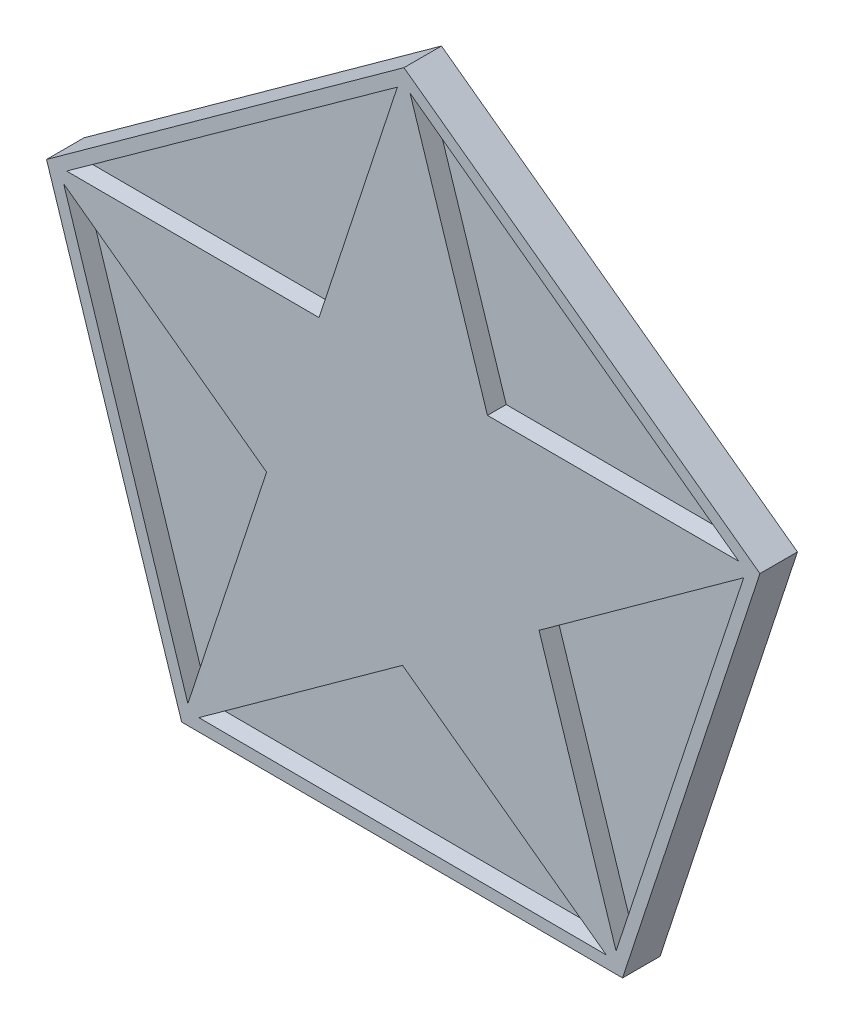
from build123d import *

# Parameters (mm, degrees)
SALIENTE_EXTRUIR1_DEPTH = 1
CORTAR_EXTRUIR1_DEPTH   = 0.5
SALIENTE_EXTRUIR2_DEPTH = 0.5


with BuildPart() as part:
    # Croquis1 → Saliente-Extruir1 (new body)
    with BuildSketch(Plane.XY):
        Polygon((0.027506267, 9.99996217), (-9.502029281, 3.116318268), (-5.900083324, -8.073971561), (5.85557725, -8.106307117), (9.519029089, 3.063998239), align=None)
    extrude(amount=SALIENTE_EXTRUIR1_DEPTH)

    # Croquis2 → Cortar-Extruir1 (cut)
    with BuildSketch(Plane.XY.offset(1)):
        Polygon((0.042555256, 9.600245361), (-9.117225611, 3.00711142), (-5.677310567, -7.741748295), (5.608454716, -7.791774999), (9.143526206, 2.926166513), align=None)
    extrude(amount=-CORTAR_EXTRUIR1_DEPTH, mode=Mode.SUBTRACT)

    # Croquis3 → Saliente-Extruir2 (add)
    with BuildSketch(Plane.XY.offset(0.5)):
        Polygon((-5.900083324, -8.073971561), (-0.010506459, -3.819645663), (5.85557725, -8.106307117), (3.629452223, -1.190327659), (9.519029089, 3.063998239), (2.253631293, 3.083982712), (0.027506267, 9.99996217), (-2.236631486, 3.096333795), (-9.502029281, 3.116318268), (-3.635945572, -1.170343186), align=None)
    extrude(amount=SALIENTE_EXTRUIR2_DEPTH)


solid = part.part
